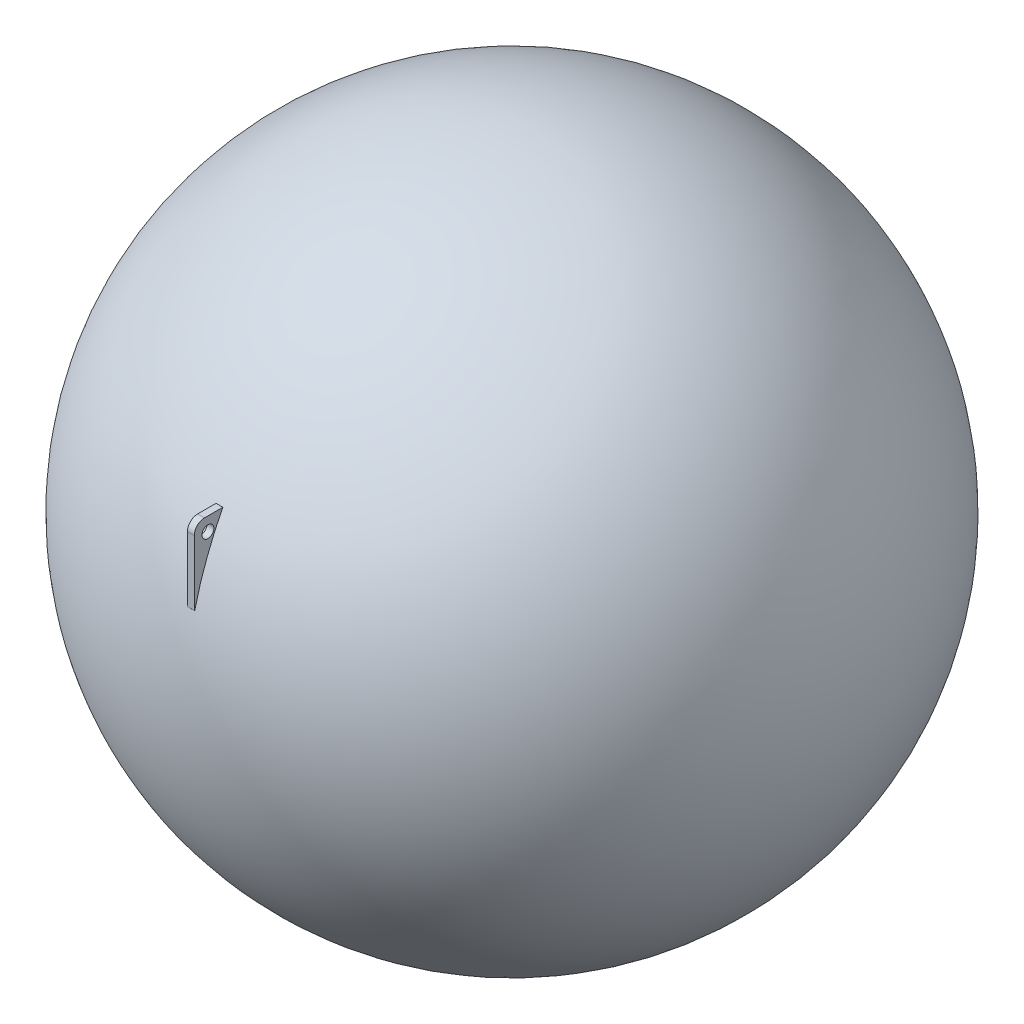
from build123d import *

# Parameters (mm, degrees)
BOSS_EXTRUDE1_REACH      = 2978.105
BOSS_EXTRUDE1_END_RADIUS = 1225.55
SKETCH2_W                = 25.4
SKETCH2_H                = 279.4
SKETCH3_R                = 22.225
CUT_EXTRUDE1_DEPTH       = 25.4
FILLET1_R                = 38.1


with BuildPart() as part:
    # Sketch1 → Revolve1 (revolve)
    with BuildSketch(Plane(origin=(0, 0, 0), x_dir=(1, 0, 0), z_dir=(0, 1, 0))):
        with BuildLine():
            Line((0, 1225.55), (0, -1225.55))
            ThreePointArc((0, -1225.55), (-1225.55, 0), (0, 1225.55))
        make_face()
    revolve(axis=Axis((0, 0, -88.99), (0, 0, 1)))


with BuildPart() as body_2:
    # Boss-Extrude1: up to this sphere (the profile starts outside it)
    boss_extrude1_end = Location((0, 0, 0)) * Sphere(BOSS_EXTRUDE1_END_RADIUS, mode=Mode.PRIVATE)
    # Sketch2 → Boss-Extrude1 (new, up to the surface)
    with BuildSketch(Plane.XY.offset(1193.8), mode=Mode.PRIVATE) as boss_extrude1_sk1:
        with Locations((0, 425.45)):
            Rectangle(SKETCH2_W, SKETCH2_H)
    boss_extrude1_tool1 = extrude(boss_extrude1_sk1.sketch, amount=-BOSS_EXTRUDE1_REACH, mode=Mode.PRIVATE) - boss_extrude1_end
    add(boss_extrude1_tool1.solids().sort_by_distance((0, 425.45, 1193.8))[0])

    # Sketch3 → Cut-Extrude1 (cut)
    with BuildSketch(Plane(origin=(12.7, 0, 0), x_dir=(0, 0, -1), z_dir=(1, 0, 0))):
        with Locations(Location((-1143, 514.35, 0), (0, 0, 90))):
            Circle(SKETCH3_R)
    extrude(amount=-CUT_EXTRUDE1_DEPTH, mode=Mode.SUBTRACT)

    # Fillet1
    fillet1_edges = [body_2.edges().sort_by_distance(p)[0] for p in [
        (0, 565.15, 1193.8),
    ]]
    fillet(fillet1_edges, radius=FILLET1_R)


solid = Compound([part.part, body_2.part])
